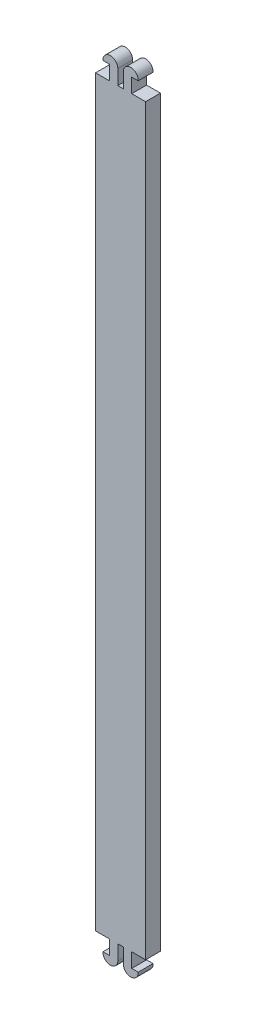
from build123d import *

# Parameters (mm, degrees)
BOSS_EXTRUDE1_DEPTH = 3


with BuildPart() as part:
    # Sketch1 → Boss-Extrude1 (new body)
    with BuildSketch(Plane.XY):
        with BuildLine():
            Line((5.05, -112.5), (5.05, 37.5))
            Line((5.05, 37.5), (2.254, 37.5))
            Line((2.254, 37.5), (2.254, 40.4))
            Line((2.254, 40.4), (3.55867185, 40.4))
            ThreePointArc((3.55867185, 40.4), (2.108027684, 42.003167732), (0.554, 40.5))
            Line((0.554, 40.5), (0.554, 37.5))
            Line((0.554, 37.5), (-0.554, 37.5))
            Line((-0.554, 37.5), (-0.554, 40.5))
            ThreePointArc((-0.554, 40.5), (-2.108027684, 42.003167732), (-3.55867185, 40.4))
            Line((-3.55867185, 40.4), (-2.254, 40.4))
            Line((-2.254, 40.4), (-2.254, 37.5))
            Line((-2.254, 37.5), (-5.05, 37.5))
            Line((-5.05, 37.5), (-5.05, -112.5))
            Line((-5.05, -112.5), (-2.254, -112.5))
            Line((-2.254, -112.5), (-2.254, -115.4))
            Line((-2.254, -115.4), (-3.55867185, -115.4))
            ThreePointArc((-3.55867185, -115.4), (-2.108027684, -117.003167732), (-0.554, -115.5))
            Line((-0.554, -115.5), (-0.554, -112.5))
            Line((-0.554, -112.5), (0.554, -112.5))
            Line((0.554, -112.5), (0.554, -115.5))
            ThreePointArc((0.554, -115.5), (2.108027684, -117.003167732), (3.55867185, -115.4))
            Line((3.55867185, -115.4), (2.254, -115.4))
            Line((2.254, -115.4), (2.254, -112.5))
            Line((2.254, -112.5), (5.05, -112.5))
        make_face()
    extrude(amount=BOSS_EXTRUDE1_DEPTH)


solid = part.part
